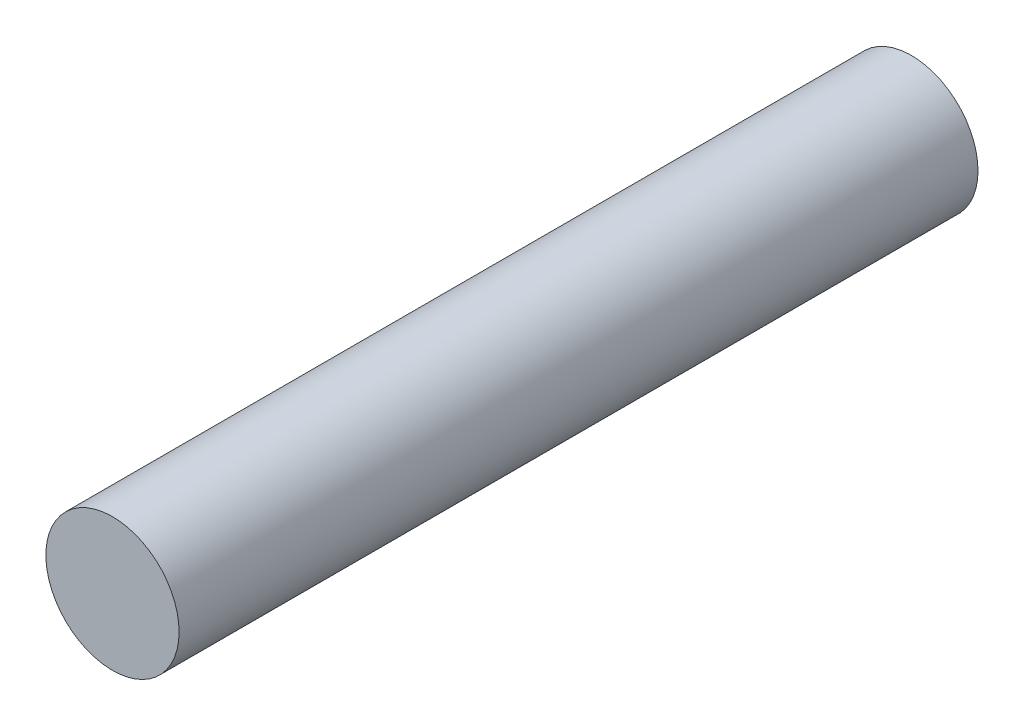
ISO-10303-21;
HEADER;
FILE_DESCRIPTION(('STEP AP214'),'2;1');
FILE_NAME('part.step','',(''),(''),'','','');
FILE_SCHEMA(('AUTOMOTIVE_DESIGN { 1 0 10303 214 1 1 1 1 }'));
ENDSEC;
DATA;
#1=APPLICATION_CONTEXT('core data for automotive mechanical design processes');
#2=APPLICATION_PROTOCOL_DEFINITION('international standard','automotive_design',2000,#1);
#3=PRODUCT_CONTEXT('',#1,'mechanical');
#4=PRODUCT('Part','Part','',(#3));
#5=PRODUCT_RELATED_PRODUCT_CATEGORY('part','',(#4));
#6=PRODUCT_DEFINITION_FORMATION('','',#4);
#7=PRODUCT_DEFINITION_CONTEXT('part definition',#1,'design');
#8=PRODUCT_DEFINITION('design','',#6,#7);
#9=PRODUCT_DEFINITION_SHAPE('','',#8);
#10=(LENGTH_UNIT() NAMED_UNIT(*) SI_UNIT(.MILLI.,.METRE.));
#11=(NAMED_UNIT(*) PLANE_ANGLE_UNIT() SI_UNIT($,.RADIAN.));
#12=(NAMED_UNIT(*) SI_UNIT($,.STERADIAN.) SOLID_ANGLE_UNIT());
#13=UNCERTAINTY_MEASURE_WITH_UNIT(LENGTH_MEASURE(1.E-05),#10,'distance_accuracy_value','');
#14=(GEOMETRIC_REPRESENTATION_CONTEXT(3) GLOBAL_UNCERTAINTY_ASSIGNED_CONTEXT((#13)) GLOBAL_UNIT_ASSIGNED_CONTEXT((#10,
#11,#12)) REPRESENTATION_CONTEXT('',''));
#15=CARTESIAN_POINT('',(0.,0.,0.));
#16=DIRECTION('',(0.,0.,1.));
#17=DIRECTION('',(1.,0.,0.));
#18=AXIS2_PLACEMENT_3D('',#15,#16,#17);
#19=CARTESIAN_POINT('',(0.,0.,14.99));
#20=DIRECTION('',(0.,0.,-1.));
#21=DIRECTION('',(-1.,0.,0.));
#22=AXIS2_PLACEMENT_3D('',#19,#20,#21);
#23=CYLINDRICAL_SURFACE('',#22,1.25);
#24=CARTESIAN_POINT('',(0.,0.,14.99));
#25=DIRECTION('',(0.,0.,1.));
#26=DIRECTION('',(1.,0.,0.));
#27=AXIS2_PLACEMENT_3D('',#24,#25,#26);
#28=CIRCLE('',#27,1.25);
#29=CARTESIAN_POINT('',(1.25,0.,14.99));
#30=VERTEX_POINT('',#29);
#31=EDGE_CURVE('E10',#30,#30,#28,.T.);
#32=ORIENTED_EDGE('',*,*,#31,.F.);
#33=EDGE_LOOP('',(#32));
#34=FACE_BOUND('',#33,.T.);
#35=CARTESIAN_POINT('',(0.,0.,0.));
#36=DIRECTION('',(0.,0.,1.));
#37=DIRECTION('',(1.,0.,0.));
#38=AXIS2_PLACEMENT_3D('',#35,#36,#37);
#39=CIRCLE('',#38,1.25);
#40=CARTESIAN_POINT('',(1.25,0.,0.));
#41=VERTEX_POINT('',#40);
#42=EDGE_CURVE('E352',#41,#41,#39,.T.);
#43=ORIENTED_EDGE('',*,*,#42,.T.);
#44=EDGE_LOOP('',(#43));
#45=FACE_BOUND('',#44,.T.);
#46=ADVANCED_FACE('F346',(#34,#45),#23,.T.);
#47=CARTESIAN_POINT('',(0.,0.,14.99));
#48=DIRECTION('',(0.,0.,1.));
#49=DIRECTION('',(1.,0.,0.));
#50=AXIS2_PLACEMENT_3D('',#47,#48,#49);
#51=PLANE('',#50);
#52=ORIENTED_EDGE('',*,*,#31,.T.);
#53=EDGE_LOOP('',(#52));
#54=FACE_BOUND('',#53,.T.);
#55=ADVANCED_FACE('F361',(#54),#51,.T.);
#56=CARTESIAN_POINT('',(0.,0.,0.));
#57=DIRECTION('',(0.,0.,1.));
#58=DIRECTION('',(1.,0.,0.));
#59=AXIS2_PLACEMENT_3D('',#56,#57,#58);
#60=PLANE('',#59);
#61=ORIENTED_EDGE('',*,*,#42,.F.);
#62=EDGE_LOOP('',(#61));
#63=FACE_BOUND('',#62,.T.);
#64=ADVANCED_FACE('F359',(#63),#60,.F.);
#65=CLOSED_SHELL('',(#46,#55,#64));
#66=MANIFOLD_SOLID_BREP('B2',#65);
#67=ADVANCED_BREP_SHAPE_REPRESENTATION('',(#18,#66),#14);
#68=SHAPE_DEFINITION_REPRESENTATION(#9,#67);
ENDSEC;
END-ISO-10303-21;
